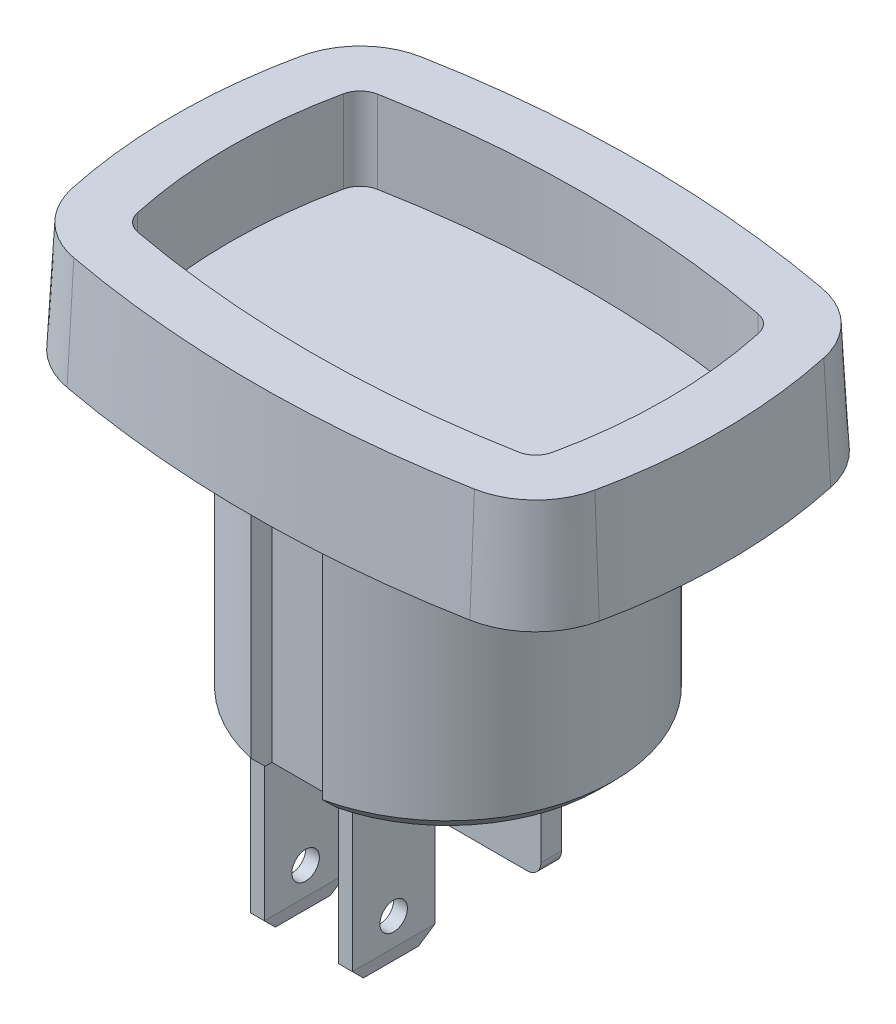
from build123d import *
from OCP.BRepFilletAPI import BRepFilletAPI_MakeChamfer

# Parameters (mm, degrees)
BOSS_EXTRU_1_DEPTH           = 4
BOSS_EXTRU_1_TAPER           = 3
ENL_V_MAT_EXTRU_1_DEPTH      = 3
ESQUISSE5_W                  = 2.6
ESQUISSE5_H                  = 0.9
ENL_V_MAT_EXTRU_2_DEPTH      = 9.5
BOSS_EXTRU_2_DEPTH           = 0.375
ESQUISSE9_W                  = 0.5
ESQUISSE9_H                  = 3
BOSS_EXTRU_3_DEPTH           = 7
CHANFREIN1_SIZE              = 0.5
CHANFREIN1_SIZE2             = 0.1
CHANFREIN2_SIZE              = 0.5
ENL_V_MAT_EXTRU_3_DEPTH      = 21.666700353
ENL_V_MAT_EXTRU_3_DEPTH_BACK = 21.666700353
ESQUISSE10_R                 = 0.5


with BuildPart() as part:
    # Esquisse2 → Boss.-Extru.1 (new body)
    with BuildSketch(Plane(origin=(0, 0, 0), x_dir=(1, 0, 0), z_dir=(0, 1, 0))):
        with BuildLine():
            ThreePointArc((-7.31866051, 6.52476584), (-8.861286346, 5.726110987), (-9.702659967, 4.206362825))
            ThreePointArc((-9.702659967, 4.206362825), (-10.15, 0), (-9.702659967, -4.206362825))
            ThreePointArc((-9.702659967, -4.206362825), (-8.861286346, -5.726110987), (-7.31866051, -6.52476584))
            ThreePointArc((-7.31866051, -6.52476584), (0, -7.2), (7.31866051, -6.52476584))
            ThreePointArc((7.31866051, -6.52476584), (8.861286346, -5.726110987), (9.702659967, -4.206362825))
            ThreePointArc((9.702659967, -4.206362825), (10.15, 0), (9.702659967, 4.206362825))
            ThreePointArc((9.702659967, 4.206362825), (8.861286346, 5.726110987), (7.31866051, 6.52476584))
            ThreePointArc((7.31866051, 6.52476584), (0, 7.2), (-7.31866051, 6.52476584))
        make_face()
    extrude(amount=BOSS_EXTRU_1_DEPTH, taper=BOSS_EXTRU_1_TAPER)

    # Esquisse3 → Enl_v. mat.-Extru.1 (cut)
    with BuildSketch(Plane(origin=(0, 4, 0), x_dir=(1, 0, 0), z_dir=(0, 1, 0))):
        with BuildLine():
            ThreePointArc((-6.91437201, 4.352435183), (-7.320786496, 4.142024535), (-7.542451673, 3.741637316))
            ThreePointArc((-7.542451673, 3.741637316), (-7.940368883, 0), (-7.542451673, -3.741637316))
            ThreePointArc((-7.542451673, -3.741637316), (-7.320786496, -4.142024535), (-6.91437201, -4.352435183))
            ThreePointArc((-6.91437201, -4.352435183), (0, -4.990368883), (6.91437201, -4.352435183))
            ThreePointArc((6.91437201, -4.352435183), (7.320786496, -4.142024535), (7.542451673, -3.741637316))
            ThreePointArc((7.542451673, -3.741637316), (7.940368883, 0), (7.542451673, 3.741637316))
            ThreePointArc((7.542451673, 3.741637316), (7.320786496, 4.142024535), (6.91437201, 4.352435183))
            ThreePointArc((6.91437201, 4.352435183), (0, 4.990368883), (-6.91437201, 4.352435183))
        make_face()
    extrude(amount=-ENL_V_MAT_EXTRU_1_DEPTH, mode=Mode.SUBTRACT)

    # Esquisse4 → R_volution1 (revolve)
    with BuildSketch(Plane.XY, mode=Mode.PRIVATE) as r_volution1_sk:
        Polygon((0, 0), (-6, 0), (-6, -9), (-5.5, -9.5), (0, -9.5), align=None)
    revolve(r_volution1_sk.sketch.rotate(Axis((0, 0, 0), (0, -1, 0)), 270), axis=Axis((0, 0, 0), (0, -1, 0)))

    # Esquisse5 → Enl_v. mat.-Extru.2 (cut)
    with BuildSketch(Plane.XZ.offset(9.5)):
        with Locations((0, 5.55)):
            Rectangle(ESQUISSE5_W, ESQUISSE5_H)
        with Locations((0, -5.55)):
            Rectangle(ESQUISSE5_W, ESQUISSE5_H)
    extrude(amount=-ENL_V_MAT_EXTRU_2_DEPTH, mode=Mode.SUBTRACT)

    # Esquisse8 → Boss.-Extru.2 (add, symmetric)
    with BuildSketch(Plane.XY):
        with BuildLine():
            Line((-3.75, -9.5), (3.75, -9.5))
            Line((3.75, -9.5), (3.75, -12.5))
            ThreePointArc((3.75, -12.5), (3.603553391, -12.853553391), (3.25, -13))
            Line((3.25, -13), (-3.25, -13))
            ThreePointArc((-3.25, -13), (-3.603553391, -12.853553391), (-3.75, -12.5))
            Line((-3.75, -12.5), (-3.75, -9.5))
        make_face()
    extrude(amount=BOSS_EXTRU_2_DEPTH, both=True)

    # Esquisse9 → Boss.-Extru.3 (add)
    with BuildSketch(Plane.XZ.offset(9.5)):
        with Locations((0, 2.225)):
            Rectangle(ESQUISSE9_W, ESQUISSE9_H)
        with Locations((-3.2, 2.225)):
            Rectangle(ESQUISSE9_W, ESQUISSE9_H)
    extrude(amount=BOSS_EXTRU_3_DEPTH)

    # Chanfrein1: one chamfer whose edges measure the first distance from different faces: ONE call of the kernel's chamfer builder (chamfer() names one face for all edges)
    chanfrein1_edges_1 = [part.edges().sort_by_distance(p)[0] for p in [
        (-0.25, -16.5, 2.225),
    ]]
    chanfrein1_side_1 = [part.faces().sort_by_distance(p)[0] for p in [
        (-0.25, -13, 2.225),
    ]]
    chanfrein1_edges_2 = [part.edges().sort_by_distance(p)[0] for p in [
        (0.25, -16.5, 2.225),
    ]]
    chanfrein1_side_2 = [part.faces().sort_by_distance(p)[0] for p in [
        (0.25, -13, 2.225),
    ]]
    chanfrein1_edges_3 = [part.edges().sort_by_distance(p)[0] for p in [
        (-3.45, -16.5, 2.225),
    ]]
    chanfrein1_side_3 = [part.faces().sort_by_distance(p)[0] for p in [
        (-3.45, -13, 2.225),
    ]]
    chanfrein1_edges_4 = [part.edges().sort_by_distance(p)[0] for p in [
        (-2.95, -16.5, 2.225),
    ]]
    chanfrein1_side_4 = [part.faces().sort_by_distance(p)[0] for p in [
        (-2.95, -13, 2.225),
    ]]
    chanfrein1 = BRepFilletAPI_MakeChamfer(part.part.solid().wrapped)
    for e in chanfrein1_edges_1:
        chanfrein1.Add(CHANFREIN1_SIZE, CHANFREIN1_SIZE2, e.wrapped, chanfrein1_side_1[0].wrapped)  # the first distance lies on this face
    for e in chanfrein1_edges_2:
        chanfrein1.Add(CHANFREIN1_SIZE, CHANFREIN1_SIZE2, e.wrapped, chanfrein1_side_2[0].wrapped)  # the first distance lies on this face
    for e in chanfrein1_edges_3:
        chanfrein1.Add(CHANFREIN1_SIZE, CHANFREIN1_SIZE2, e.wrapped, chanfrein1_side_3[0].wrapped)  # the first distance lies on this face
    for e in chanfrein1_edges_4:
        chanfrein1.Add(CHANFREIN1_SIZE, CHANFREIN1_SIZE2, e.wrapped, chanfrein1_side_4[0].wrapped)  # the first distance lies on this face
    add(Compound.cast(chanfrein1.Shape()), mode=Mode.REPLACE)

    # Chanfrein2
    chanfrein2_edges = [part.edges().sort_by_distance(p)[0] for p in [
        (0, -16.5, 0.725),
        (-3.2, -16.5, 0.725),
        (0, -16.5, 3.725),
        (-3.2, -16.5, 3.725),
    ]]
    chamfer(chanfrein2_edges, length=CHANFREIN2_SIZE)

    # Esquisse10 → Enl_v. mat.-Extru.3 (cut, two sides: drawn at the far end of the back side and taken through both)
    with BuildSketch(Plane(origin=(0, 0, 0), x_dir=(0, 0, -1), z_dir=(1, 0, 0)).offset(-ENL_V_MAT_EXTRU_3_DEPTH_BACK)):
        with Locations((-2.225, -15)):
            Circle(ESQUISSE10_R)
    extrude(amount=ENL_V_MAT_EXTRU_3_DEPTH + ENL_V_MAT_EXTRU_3_DEPTH_BACK, mode=Mode.SUBTRACT)


solid = part.part
